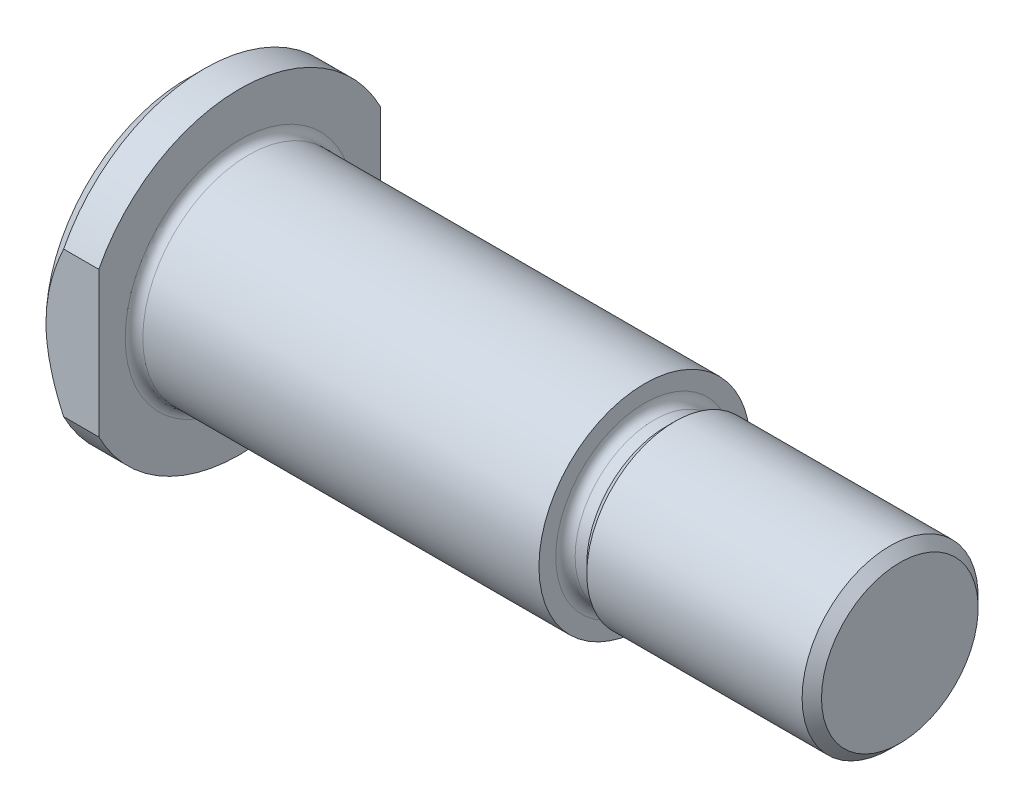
ISO-10303-21;
HEADER;
FILE_DESCRIPTION(('STEP AP214'),'2;1');
FILE_NAME('part.step','',(''),(''),'','','');
FILE_SCHEMA(('AUTOMOTIVE_DESIGN { 1 0 10303 214 1 1 1 1 }'));
ENDSEC;
DATA;
#1=APPLICATION_CONTEXT('core data for automotive mechanical design processes');
#2=APPLICATION_PROTOCOL_DEFINITION('international standard','automotive_design',2000,#1);
#3=PRODUCT_CONTEXT('',#1,'mechanical');
#4=PRODUCT('Part','Part','',(#3));
#5=PRODUCT_RELATED_PRODUCT_CATEGORY('part','',(#4));
#6=PRODUCT_DEFINITION_FORMATION('','',#4);
#7=PRODUCT_DEFINITION_CONTEXT('part definition',#1,'design');
#8=PRODUCT_DEFINITION('design','',#6,#7);
#9=PRODUCT_DEFINITION_SHAPE('','',#8);
#10=(LENGTH_UNIT() NAMED_UNIT(*) SI_UNIT(.MILLI.,.METRE.));
#11=(NAMED_UNIT(*) PLANE_ANGLE_UNIT() SI_UNIT($,.RADIAN.));
#12=(NAMED_UNIT(*) SI_UNIT($,.STERADIAN.) SOLID_ANGLE_UNIT());
#13=UNCERTAINTY_MEASURE_WITH_UNIT(LENGTH_MEASURE(1.E-05),#10,'distance_accuracy_value','');
#14=(GEOMETRIC_REPRESENTATION_CONTEXT(3) GLOBAL_UNCERTAINTY_ASSIGNED_CONTEXT((#13)) GLOBAL_UNIT_ASSIGNED_CONTEXT((#10,
#11,#12)) REPRESENTATION_CONTEXT('',''));
#15=CARTESIAN_POINT('',(0.,0.,0.));
#16=DIRECTION('',(0.,0.,1.));
#17=DIRECTION('',(1.,0.,0.));
#18=AXIS2_PLACEMENT_3D('',#15,#16,#17);
#19=CARTESIAN_POINT('',(-6.34999999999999,0.,0.));
#20=DIRECTION('',(-1.,0.,0.));
#21=DIRECTION('',(0.,0.,1.));
#22=AXIS2_PLACEMENT_3D('',#19,#20,#21);
#23=CYLINDRICAL_SURFACE('',#22,18.);
#24=DIRECTION('',(-1.,0.,0.));
#25=VECTOR('',#24,1.);
#26=CARTESIAN_POINT('',(-6.34999999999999,8.24621125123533,16.));
#27=LINE('',#26,#25);
#28=CARTESIAN_POINT('',(6.,8.24621125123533,16.));
#29=VERTEX_POINT('',#28);
#30=CARTESIAN_POINT('',(2.,8.24621125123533,16.));
#31=VERTEX_POINT('',#30);
#32=EDGE_CURVE('E84',#29,#31,#27,.T.);
#33=ORIENTED_EDGE('',*,*,#32,.F.);
#34=CARTESIAN_POINT('',(6.,0.,0.));
#35=DIRECTION('',(-1.,0.,0.));
#36=DIRECTION('',(0.,0.,1.));
#37=AXIS2_PLACEMENT_3D('',#34,#35,#36);
#38=CIRCLE('',#37,18.);
#39=CARTESIAN_POINT('',(6.,8.24621125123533,-16.));
#40=VERTEX_POINT('',#39);
#41=EDGE_CURVE('E96',#29,#40,#38,.T.);
#42=ORIENTED_EDGE('',*,*,#41,.T.);
#43=DIRECTION('',(-1.,0.,0.));
#44=VECTOR('',#43,1.);
#45=CARTESIAN_POINT('',(-6.34999999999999,8.24621125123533,-16.));
#46=LINE('',#45,#44);
#47=CARTESIAN_POINT('',(2.,8.24621125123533,-16.));
#48=VERTEX_POINT('',#47);
#49=EDGE_CURVE('E176',#48,#40,#46,.F.);
#50=ORIENTED_EDGE('',*,*,#49,.F.);
#51=CARTESIAN_POINT('',(2.,0.,0.));
#52=DIRECTION('',(-1.,0.,0.));
#53=DIRECTION('',(0.,0.,1.));
#54=AXIS2_PLACEMENT_3D('',#51,#52,#53);
#55=CIRCLE('',#54,18.);
#56=EDGE_CURVE('E98',#31,#48,#55,.T.);
#57=ORIENTED_EDGE('',*,*,#56,.F.);
#58=EDGE_LOOP('',(#33,#42,#50,#57));
#59=FACE_BOUND('',#58,.T.);
#60=ADVANCED_FACE('F35',(#59),#23,.T.);
#61=CARTESIAN_POINT('',(0.,0.,0.));
#62=DIRECTION('',(1.,0.,0.));
#63=DIRECTION('',(0.,0.,-1.));
#64=AXIS2_PLACEMENT_3D('',#61,#62,#63);
#65=CONICAL_SURFACE('',#64,16.,0.785398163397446);
#66=CARTESIAN_POINT('',(4.23631170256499,-12.3898471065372,16.));
#67=CARTESIAN_POINT('',(4.05147895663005,-12.087915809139,16.));
#68=CARTESIAN_POINT('',(3.86966755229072,-11.7841061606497,16.));
#69=CARTESIAN_POINT('',(3.51303537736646,-11.172315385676,16.));
#70=CARTESIAN_POINT('',(3.33821634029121,-10.8643332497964,16.));
#71=CARTESIAN_POINT('',(2.99588293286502,-10.2426127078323,16.));
#72=CARTESIAN_POINT('',(2.82840276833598,-9.92885539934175,16.));
#73=CARTESIAN_POINT('',(2.50276930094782,-9.29655507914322,16.));
#74=CARTESIAN_POINT('',(2.34461538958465,-8.97801238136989,16.));
#75=CARTESIAN_POINT('',(2.03589919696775,-8.32926566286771,16.));
#76=CARTESIAN_POINT('',(1.88555682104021,-7.99895624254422,16.));
#77=CARTESIAN_POINT('',(1.59771441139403,-7.33279308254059,16.));
#78=CARTESIAN_POINT('',(1.46021552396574,-6.99693885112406,16.));
#79=CARTESIAN_POINT('',(1.07025580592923,-5.98189570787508,16.));
#80=CARTESIAN_POINT('',(0.839686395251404,-5.29390269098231,16.));
#81=CARTESIAN_POINT('',(0.536854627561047,-4.19695393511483,16.));
#82=CARTESIAN_POINT('',(0.439117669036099,-3.79494869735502,16.));
#83=CARTESIAN_POINT('',(0.271263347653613,-2.98509748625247,16.));
#84=CARTESIAN_POINT('',(0.201147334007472,-2.5772512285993,16.));
#85=CARTESIAN_POINT('',(0.0916160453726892,-1.76124873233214,16.));
#86=CARTESIAN_POINT('',(0.0519236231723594,-1.35313003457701,16.));
#87=CARTESIAN_POINT('',(0.00373371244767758,-0.535035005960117,16.));
#88=CARTESIAN_POINT('',(-0.004763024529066,-0.125058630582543,16.));
#89=CARTESIAN_POINT('',(0.0110887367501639,0.765238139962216,16.));
#90=CARTESIAN_POINT('',(0.0413716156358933,1.24546215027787,16.));
#91=CARTESIAN_POINT('',(0.143735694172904,2.20143974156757,16.));
#92=CARTESIAN_POINT('',(0.215825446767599,2.67719238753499,16.));
#93=CARTESIAN_POINT('',(0.399314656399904,3.62736179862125,16.));
#94=CARTESIAN_POINT('',(0.51121168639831,4.10168125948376,16.));
#95=CARTESIAN_POINT('',(0.7691655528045,5.04072046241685,16.));
#96=CARTESIAN_POINT('',(0.915216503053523,5.50544184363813,16.));
#97=CARTESIAN_POINT('',(1.26343533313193,6.50228790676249,16.));
#98=CARTESIAN_POINT('',(1.47091462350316,7.03254392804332,16.));
#99=CARTESIAN_POINT('',(1.91796697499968,8.07946920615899,16.));
#100=CARTESIAN_POINT('',(2.15755521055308,8.59613189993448,16.));
#101=CARTESIAN_POINT('',(2.66319768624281,9.61836359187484,16.));
#102=CARTESIAN_POINT('',(2.92933668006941,10.1238903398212,16.));
#103=CARTESIAN_POINT('',(3.48220267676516,11.1233766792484,16.));
#104=CARTESIAN_POINT('',(3.76892640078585,11.6173380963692,16.));
#105=CARTESIAN_POINT('',(4.34625875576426,12.5741556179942,16.));
#106=CARTESIAN_POINT('',(4.63616885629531,13.0374353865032,16.));
#107=CARTESIAN_POINT('',(5.22843648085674,13.955993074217,16.));
#108=CARTESIAN_POINT('',(5.53079499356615,14.4112703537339,16.));
#109=CARTESIAN_POINT('',(6.14324612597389,15.3111433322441,16.));
#110=CARTESIAN_POINT('',(6.45325536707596,15.7557959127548,16.));
#111=CARTESIAN_POINT('',(6.92452438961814,16.4182167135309,16.));
#112=CARTESIAN_POINT('',(7.08263534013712,16.6382352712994,16.));
#113=CARTESIAN_POINT('',(7.40078352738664,17.0768686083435,16.));
#114=CARTESIAN_POINT('',(7.56082072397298,17.2954834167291,16.));
#115=CARTESIAN_POINT('',(7.72173860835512,17.5134486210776,16.));
#116=B_SPLINE_CURVE_WITH_KNOTS('',3,(#66,#67,#68,#69,#70,#71,#72,#73,#74,#75,#76,#77,#78,#79,
#80,#81,#82,#83,#84,#85,#86,#87,#88,#89,#90,#91,#92,#93,#94,#95,#96,#97,#98,#99,#100,#101,#102,
#103,#104,#105,#106,#107,#108,#109,#110,#111,#112,#113,#114,#115),.UNSPECIFIED.,.F.,.F.,(4,2,2,
2,2,2,2,2,2,2,2,2,2,2,2,2,2,2,2,2,2,2,2,2,4),(0.,1.06205923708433,2.12438016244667,
3.19121635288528,4.25798285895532,5.34645202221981,6.43501823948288,8.60774448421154,
9.84810200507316,11.0885201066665,12.3174995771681,13.5465086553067,14.9880626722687,
16.429911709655,17.8904558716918,19.3507485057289,21.0576172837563,22.7652955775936,
24.4786109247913,26.1916539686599,27.8309565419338,29.470389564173,31.0964272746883,
31.9092319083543,32.7220196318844),.UNSPECIFIED.);
#117=CARTESIAN_POINT('',(0.,0.,16.));
#118=VERTEX_POINT('',#117);
#119=EDGE_CURVE('E50',#31,#118,#116,.F.);
#120=ORIENTED_EDGE('',*,*,#119,.F.);
#121=ORIENTED_EDGE('',*,*,#56,.T.);
#122=CARTESIAN_POINT('',(4.236311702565,-12.3898471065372,-16.));
#123=CARTESIAN_POINT('',(4.05147895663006,-12.087915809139,-16.));
#124=CARTESIAN_POINT('',(3.86966755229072,-11.7841061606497,-16.));
#125=CARTESIAN_POINT('',(3.51303537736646,-11.172315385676,-16.));
#126=CARTESIAN_POINT('',(3.33821634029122,-10.8643332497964,-16.));
#127=CARTESIAN_POINT('',(2.99588293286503,-10.2426127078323,-16.));
#128=CARTESIAN_POINT('',(2.82840276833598,-9.92885539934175,-16.));
#129=CARTESIAN_POINT('',(2.50276930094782,-9.29655507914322,-16.));
#130=CARTESIAN_POINT('',(2.34461538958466,-8.97801238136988,-16.));
#131=CARTESIAN_POINT('',(2.03589919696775,-8.32926566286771,-16.));
#132=CARTESIAN_POINT('',(1.88555682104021,-7.99895624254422,-16.));
#133=CARTESIAN_POINT('',(1.59771441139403,-7.33279308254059,-16.));
#134=CARTESIAN_POINT('',(1.46021552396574,-6.99693885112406,-16.));
#135=CARTESIAN_POINT('',(1.07025580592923,-5.98189570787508,-16.));
#136=CARTESIAN_POINT('',(0.839686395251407,-5.29390269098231,-16.));
#137=CARTESIAN_POINT('',(0.53685462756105,-4.19695393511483,-16.));
#138=CARTESIAN_POINT('',(0.439117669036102,-3.79494869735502,-16.));
#139=CARTESIAN_POINT('',(0.271263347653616,-2.98509748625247,-16.));
#140=CARTESIAN_POINT('',(0.201147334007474,-2.5772512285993,-16.));
#141=CARTESIAN_POINT('',(0.0916160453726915,-1.76124873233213,-16.));
#142=CARTESIAN_POINT('',(0.0519236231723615,-1.353130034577,-16.));
#143=CARTESIAN_POINT('',(0.00373371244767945,-0.535035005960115,-16.));
#144=CARTESIAN_POINT('',(-0.00476302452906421,-0.125058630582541,-16.));
#145=CARTESIAN_POINT('',(0.0110887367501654,0.765238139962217,-16.));
#146=CARTESIAN_POINT('',(0.0413716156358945,1.24546215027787,-16.));
#147=CARTESIAN_POINT('',(0.143735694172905,2.20143974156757,-16.));
#148=CARTESIAN_POINT('',(0.2158254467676,2.67719238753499,-16.));
#149=CARTESIAN_POINT('',(0.399314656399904,3.62736179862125,-16.));
#150=CARTESIAN_POINT('',(0.511211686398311,4.10168125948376,-16.));
#151=CARTESIAN_POINT('',(0.7691655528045,5.04072046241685,-16.));
#152=CARTESIAN_POINT('',(0.915216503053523,5.50544184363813,-16.));
#153=CARTESIAN_POINT('',(1.26343533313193,6.50228790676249,-16.));
#154=CARTESIAN_POINT('',(1.47091462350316,7.03254392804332,-16.));
#155=CARTESIAN_POINT('',(1.91796697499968,8.07946920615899,-16.));
#156=CARTESIAN_POINT('',(2.15755521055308,8.59613189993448,-16.));
#157=CARTESIAN_POINT('',(2.6631976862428,9.61836359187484,-16.));
#158=CARTESIAN_POINT('',(2.9293366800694,10.1238903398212,-16.));
#159=CARTESIAN_POINT('',(3.48220267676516,11.1233766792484,-16.));
#160=CARTESIAN_POINT('',(3.76892640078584,11.6173380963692,-16.));
#161=CARTESIAN_POINT('',(4.34625875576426,12.5741556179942,-16.));
#162=CARTESIAN_POINT('',(4.63616885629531,13.0374353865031,-16.));
#163=CARTESIAN_POINT('',(5.22843648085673,13.955993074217,-16.));
#164=CARTESIAN_POINT('',(5.53079499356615,14.4112703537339,-16.));
#165=CARTESIAN_POINT('',(6.14324612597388,15.3111433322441,-16.));
#166=CARTESIAN_POINT('',(6.45325536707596,15.7557959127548,-16.));
#167=CARTESIAN_POINT('',(6.92452438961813,16.4182167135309,-16.));
#168=CARTESIAN_POINT('',(7.08263534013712,16.6382352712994,-16.));
#169=CARTESIAN_POINT('',(7.40078352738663,17.0768686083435,-16.));
#170=CARTESIAN_POINT('',(7.56082072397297,17.2954834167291,-16.));
#171=CARTESIAN_POINT('',(7.72173860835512,17.5134486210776,-16.));
#172=B_SPLINE_CURVE_WITH_KNOTS('',3,(#122,#123,#124,#125,#126,#127,#128,#129,#130,#131,#132,
#133,#134,#135,#136,#137,#138,#139,#140,#141,#142,#143,#144,#145,#146,#147,#148,#149,#150,#151,
#152,#153,#154,#155,#156,#157,#158,#159,#160,#161,#162,#163,#164,#165,#166,#167,#168,#169,#170,
#171),.UNSPECIFIED.,.F.,.F.,(4,2,2,2,2,2,2,2,2,2,2,2,2,2,2,2,2,2,2,2,2,2,2,2,4),(0.,
1.06205923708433,2.12438016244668,3.19121635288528,4.25798285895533,5.34645202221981,
6.43501823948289,8.60774448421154,9.84810200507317,11.0885201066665,12.3174995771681,
13.5465086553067,14.9880626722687,16.429911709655,17.8904558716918,19.3507485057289,
21.0576172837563,22.7652955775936,24.4786109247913,26.1916539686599,27.8309565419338,
29.470389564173,31.0964272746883,31.9092319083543,32.7220196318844),.UNSPECIFIED.);
#173=CARTESIAN_POINT('',(0.,0.,-16.));
#174=VERTEX_POINT('',#173);
#175=EDGE_CURVE('E174',#174,#48,#172,.T.);
#176=ORIENTED_EDGE('',*,*,#175,.F.);
#177=CARTESIAN_POINT('',(0.,0.,0.));
#178=DIRECTION('',(-1.,0.,0.));
#179=DIRECTION('',(0.,0.,1.));
#180=AXIS2_PLACEMENT_3D('',#177,#178,#179);
#181=CIRCLE('',#180,16.);
#182=EDGE_CURVE('E57',#118,#174,#181,.T.);
#183=ORIENTED_EDGE('',*,*,#182,.F.);
#184=EDGE_LOOP('',(#120,#121,#176,#183));
#185=FACE_BOUND('',#184,.T.);
#186=ADVANCED_FACE('F143',(#185),#65,.T.);
#187=CARTESIAN_POINT('',(81.,8.89850000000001,0.));
#188=DIRECTION('',(1.,0.,0.));
#189=DIRECTION('',(0.,0.,-1.));
#190=AXIS2_PLACEMENT_3D('',#187,#188,#189);
#191=PLANE('',#190);
#192=CARTESIAN_POINT('',(81.,0.,0.));
#193=DIRECTION('',(-1.,0.,0.));
#194=DIRECTION('',(0.,0.,1.));
#195=AXIS2_PLACEMENT_3D('',#192,#193,#194);
#196=CIRCLE('',#195,8.89850000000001);
#197=CARTESIAN_POINT('',(81.,0.,8.89850000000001));
#198=VERTEX_POINT('',#197);
#199=EDGE_CURVE('E128',#198,#198,#196,.T.);
#200=ORIENTED_EDGE('',*,*,#199,.F.);
#201=EDGE_LOOP('',(#200));
#202=FACE_BOUND('',#201,.T.);
#203=ADVANCED_FACE('F149',(#202),#191,.T.);
#204=CARTESIAN_POINT('',(79.8985,0.,0.));
#205=DIRECTION('',(-1.,0.,0.));
#206=DIRECTION('',(0.,0.,1.));
#207=AXIS2_PLACEMENT_3D('',#204,#205,#206);
#208=CONICAL_SURFACE('',#207,10.,0.785398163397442);
#209=ORIENTED_EDGE('',*,*,#199,.T.);
#210=EDGE_LOOP('',(#209));
#211=FACE_BOUND('',#210,.T.);
#212=CARTESIAN_POINT('',(79.8985,0.,0.));
#213=DIRECTION('',(-1.,0.,0.));
#214=DIRECTION('',(0.,0.,1.));
#215=AXIS2_PLACEMENT_3D('',#212,#213,#214);
#216=CIRCLE('',#215,10.);
#217=CARTESIAN_POINT('',(79.8985,0.,10.));
#218=VERTEX_POINT('',#217);
#219=EDGE_CURVE('E125',#218,#218,#216,.T.);
#220=ORIENTED_EDGE('',*,*,#219,.F.);
#221=EDGE_LOOP('',(#220));
#222=FACE_BOUND('',#221,.T.);
#223=ADVANCED_FACE('F299',(#211,#222),#208,.T.);
#224=CARTESIAN_POINT('',(-6.34999999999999,0.,0.));
#225=DIRECTION('',(-1.,0.,0.));
#226=DIRECTION('',(0.,0.,1.));
#227=AXIS2_PLACEMENT_3D('',#224,#225,#226);
#228=CYLINDRICAL_SURFACE('',#227,10.);
#229=ORIENTED_EDGE('',*,*,#219,.T.);
#230=EDGE_LOOP('',(#229));
#231=FACE_BOUND('',#230,.T.);
#232=CARTESIAN_POINT('',(55.435815,0.,0.));
#233=DIRECTION('',(-1.,0.,0.));
#234=DIRECTION('',(0.,0.,1.));
#235=AXIS2_PLACEMENT_3D('',#232,#233,#234);
#236=CIRCLE('',#235,10.);
#237=CARTESIAN_POINT('',(55.435815,0.,10.));
#238=VERTEX_POINT('',#237);
#239=EDGE_CURVE('E122',#238,#238,#236,.T.);
#240=ORIENTED_EDGE('',*,*,#239,.F.);
#241=EDGE_LOOP('',(#240));
#242=FACE_BOUND('',#241,.T.);
#243=ADVANCED_FACE('F288',(#231,#242),#228,.T.);
#244=CARTESIAN_POINT('',(54.4233,0.,0.));
#245=DIRECTION('',(1.,0.,0.));
#246=DIRECTION('',(0.,0.,-1.));
#247=AXIS2_PLACEMENT_3D('',#244,#245,#246);
#248=CONICAL_SURFACE('',#247,8.987485,0.785398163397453);
#249=ORIENTED_EDGE('',*,*,#239,.T.);
#250=EDGE_LOOP('',(#249));
#251=FACE_BOUND('',#250,.T.);
#252=CARTESIAN_POINT('',(54.4233,0.,0.));
#253=DIRECTION('',(-1.,0.,0.));
#254=DIRECTION('',(0.,0.,1.));
#255=AXIS2_PLACEMENT_3D('',#252,#253,#254);
#256=CIRCLE('',#255,8.987485);
#257=CARTESIAN_POINT('',(54.4233,0.,8.987485));
#258=VERTEX_POINT('',#257);
#259=EDGE_CURVE('E119',#258,#258,#256,.T.);
#260=ORIENTED_EDGE('',*,*,#259,.F.);
#261=EDGE_LOOP('',(#260));
#262=FACE_BOUND('',#261,.T.);
#263=ADVANCED_FACE('F278',(#251,#262),#248,.T.);
#264=CARTESIAN_POINT('',(-6.34999999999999,0.,0.));
#265=DIRECTION('',(-1.,0.,0.));
#266=DIRECTION('',(0.,0.,1.));
#267=AXIS2_PLACEMENT_3D('',#264,#265,#266);
#268=CYLINDRICAL_SURFACE('',#267,8.987485);
#269=ORIENTED_EDGE('',*,*,#259,.T.);
#270=EDGE_LOOP('',(#269));
#271=FACE_BOUND('',#270,.T.);
#272=CARTESIAN_POINT('',(53.1015,0.,0.));
#273=DIRECTION('',(-1.,0.,0.));
#274=DIRECTION('',(0.,0.,1.));
#275=AXIS2_PLACEMENT_3D('',#272,#273,#274);
#276=CIRCLE('',#275,8.987485);
#277=CARTESIAN_POINT('',(53.1015,0.,8.987485));
#278=VERTEX_POINT('',#277);
#279=EDGE_CURVE('E116',#278,#278,#276,.T.);
#280=ORIENTED_EDGE('',*,*,#279,.F.);
#281=EDGE_LOOP('',(#280));
#282=FACE_BOUND('',#281,.T.);
#283=ADVANCED_FACE('F268',(#271,#282),#268,.T.);
#284=CARTESIAN_POINT('',(53.1015,0.,0.));
#285=DIRECTION('',(-1.,0.,0.));
#286=DIRECTION('',(0.,0.,1.));
#287=AXIS2_PLACEMENT_3D('',#284,#285,#286);
#288=TOROIDAL_SURFACE('',#287,10.088985,1.1015);
#289=ORIENTED_EDGE('',*,*,#279,.T.);
#290=EDGE_LOOP('',(#289));
#291=FACE_BOUND('',#290,.T.);
#292=CARTESIAN_POINT('',(52.,0.,0.));
#293=DIRECTION('',(-1.,0.,0.));
#294=DIRECTION('',(0.,0.,1.));
#295=AXIS2_PLACEMENT_3D('',#292,#293,#294);
#296=CIRCLE('',#295,10.088985);
#297=CARTESIAN_POINT('',(52.,0.,10.088985));
#298=VERTEX_POINT('',#297);
#299=EDGE_CURVE('E113',#298,#298,#296,.T.);
#300=ORIENTED_EDGE('',*,*,#299,.F.);
#301=EDGE_LOOP('',(#300));
#302=FACE_BOUND('',#301,.T.);
#303=ADVANCED_FACE('F258',(#291,#302),#288,.F.);
#304=CARTESIAN_POINT('',(52.,12.,0.));
#305=DIRECTION('',(1.,0.,0.));
#306=DIRECTION('',(0.,0.,-1.));
#307=AXIS2_PLACEMENT_3D('',#304,#305,#306);
#308=PLANE('',#307);
#309=ORIENTED_EDGE('',*,*,#299,.T.);
#310=EDGE_LOOP('',(#309));
#311=FACE_BOUND('',#310,.T.);
#312=CARTESIAN_POINT('',(52.,0.,0.));
#313=DIRECTION('',(-1.,0.,0.));
#314=DIRECTION('',(0.,0.,1.));
#315=AXIS2_PLACEMENT_3D('',#312,#313,#314);
#316=CIRCLE('',#315,12.);
#317=CARTESIAN_POINT('',(52.,0.,12.));
#318=VERTEX_POINT('',#317);
#319=EDGE_CURVE('E106',#318,#318,#316,.T.);
#320=ORIENTED_EDGE('',*,*,#319,.F.);
#321=EDGE_LOOP('',(#320));
#322=FACE_BOUND('',#321,.T.);
#323=ADVANCED_FACE('F218',(#311,#322),#308,.T.);
#324=CARTESIAN_POINT('',(-6.34999999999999,0.,0.));
#325=DIRECTION('',(-1.,0.,0.));
#326=DIRECTION('',(0.,0.,1.));
#327=AXIS2_PLACEMENT_3D('',#324,#325,#326);
#328=CYLINDRICAL_SURFACE('',#327,12.);
#329=CARTESIAN_POINT('',(7.,0.,0.));
#330=DIRECTION('',(1.,0.,0.));
#331=DIRECTION('',(0.,0.,-1.));
#332=AXIS2_PLACEMENT_3D('',#329,#330,#331);
#333=CIRCLE('',#332,12.);
#334=CARTESIAN_POINT('',(7.,0.,-12.));
#335=VERTEX_POINT('',#334);
#336=EDGE_CURVE('E11',#335,#335,#333,.T.);
#337=ORIENTED_EDGE('',*,*,#336,.T.);
#338=EDGE_LOOP('',(#337));
#339=FACE_BOUND('',#338,.T.);
#340=ORIENTED_EDGE('',*,*,#319,.T.);
#341=EDGE_LOOP('',(#340));
#342=FACE_BOUND('',#341,.T.);
#343=ADVANCED_FACE('F162',(#339,#342),#328,.T.);
#344=CARTESIAN_POINT('',(6.,18.,0.));
#345=DIRECTION('',(1.,0.,0.));
#346=DIRECTION('',(0.,0.,-1.));
#347=AXIS2_PLACEMENT_3D('',#344,#345,#346);
#348=PLANE('',#347);
#349=CARTESIAN_POINT('',(6.,0.,0.));
#350=DIRECTION('',(1.,0.,0.));
#351=DIRECTION('',(0.,0.,-1.));
#352=AXIS2_PLACEMENT_3D('',#349,#350,#351);
#353=CIRCLE('',#352,13.);
#354=CARTESIAN_POINT('',(6.,0.,-13.));
#355=VERTEX_POINT('',#354);
#356=EDGE_CURVE('E43',#355,#355,#353,.F.);
#357=ORIENTED_EDGE('',*,*,#356,.T.);
#358=EDGE_LOOP('',(#357));
#359=FACE_BOUND('',#358,.T.);
#360=DIRECTION('',(0.,-1.,0.));
#361=VECTOR('',#360,1.);
#362=CARTESIAN_POINT('',(6.,-18.,16.));
#363=LINE('',#362,#361);
#364=CARTESIAN_POINT('',(6.,-8.24621125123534,16.));
#365=VERTEX_POINT('',#364);
#366=EDGE_CURVE('E81',#29,#365,#363,.T.);
#367=ORIENTED_EDGE('',*,*,#366,.T.);
#368=CARTESIAN_POINT('',(6.,-8.24621125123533,-16.));
#369=VERTEX_POINT('',#368);
#370=EDGE_CURVE('E103',#369,#365,#38,.T.);
#371=ORIENTED_EDGE('',*,*,#370,.F.);
#372=DIRECTION('',(0.,1.,0.));
#373=VECTOR('',#372,1.);
#374=CARTESIAN_POINT('',(6.,-18.,-16.));
#375=LINE('',#374,#373);
#376=EDGE_CURVE('E102',#369,#40,#375,.T.);
#377=ORIENTED_EDGE('',*,*,#376,.T.);
#378=ORIENTED_EDGE('',*,*,#41,.F.);
#379=EDGE_LOOP('',(#367,#371,#377,#378));
#380=FACE_BOUND('',#379,.T.);
#381=ADVANCED_FACE('F101',(#359,#380),#348,.T.);
#382=DIRECTION('',(-1.,0.,0.));
#383=VECTOR('',#382,1.);
#384=CARTESIAN_POINT('',(-6.34999999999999,-8.24621125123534,16.));
#385=LINE('',#384,#383);
#386=CARTESIAN_POINT('',(2.,-8.24621125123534,16.));
#387=VERTEX_POINT('',#386);
#388=EDGE_CURVE('E86',#387,#365,#385,.F.);
#389=ORIENTED_EDGE('',*,*,#388,.F.);
#390=CARTESIAN_POINT('',(2.,-8.24621125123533,-16.));
#391=VERTEX_POINT('',#390);
#392=EDGE_CURVE('E104',#391,#387,#55,.T.);
#393=ORIENTED_EDGE('',*,*,#392,.F.);
#394=DIRECTION('',(-1.,0.,0.));
#395=VECTOR('',#394,1.);
#396=CARTESIAN_POINT('',(-6.34999999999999,-8.24621125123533,-16.));
#397=LINE('',#396,#395);
#398=EDGE_CURVE('E173',#369,#391,#397,.T.);
#399=ORIENTED_EDGE('',*,*,#398,.F.);
#400=ORIENTED_EDGE('',*,*,#370,.T.);
#401=EDGE_LOOP('',(#389,#393,#399,#400));
#402=FACE_BOUND('',#401,.T.);
#403=ADVANCED_FACE('F145',(#402),#23,.T.);
#404=EDGE_CURVE('E91',#118,#387,#116,.F.);
#405=ORIENTED_EDGE('',*,*,#404,.F.);
#406=EDGE_CURVE('E169',#174,#118,#181,.T.);
#407=ORIENTED_EDGE('',*,*,#406,.F.);
#408=EDGE_CURVE('E168',#391,#174,#172,.T.);
#409=ORIENTED_EDGE('',*,*,#408,.F.);
#410=ORIENTED_EDGE('',*,*,#392,.T.);
#411=EDGE_LOOP('',(#405,#407,#409,#410));
#412=FACE_BOUND('',#411,.T.);
#413=ADVANCED_FACE('F152',(#412),#65,.T.);
#414=CARTESIAN_POINT('',(0.,0.,0.));
#415=DIRECTION('',(-1.,0.,0.));
#416=DIRECTION('',(0.,0.,1.));
#417=AXIS2_PLACEMENT_3D('',#414,#415,#416);
#418=PLANE('',#417);
#419=ORIENTED_EDGE('',*,*,#406,.T.);
#420=ORIENTED_EDGE('',*,*,#182,.T.);
#421=EDGE_LOOP('',(#419,#420));
#422=FACE_BOUND('',#421,.T.);
#423=ADVANCED_FACE('F160',(#422),#418,.T.);
#424=CARTESIAN_POINT('',(42.0555127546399,-18.,-16.));
#425=DIRECTION('',(0.,0.,1.));
#426=DIRECTION('',(0.,-1.,0.));
#427=AXIS2_PLACEMENT_3D('',#424,#425,#426);
#428=PLANE('',#427);
#429=ORIENTED_EDGE('',*,*,#49,.T.);
#430=ORIENTED_EDGE('',*,*,#376,.F.);
#431=ORIENTED_EDGE('',*,*,#398,.T.);
#432=ORIENTED_EDGE('',*,*,#408,.T.);
#433=ORIENTED_EDGE('',*,*,#175,.T.);
#434=EDGE_LOOP('',(#429,#430,#431,#432,#433));
#435=FACE_BOUND('',#434,.T.);
#436=ADVANCED_FACE('F139',(#435),#428,.F.);
#437=CARTESIAN_POINT('',(42.0555127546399,-18.,16.));
#438=DIRECTION('',(0.,0.,-1.));
#439=DIRECTION('',(0.,1.,0.));
#440=AXIS2_PLACEMENT_3D('',#437,#438,#439);
#441=PLANE('',#440);
#442=ORIENTED_EDGE('',*,*,#388,.T.);
#443=ORIENTED_EDGE('',*,*,#366,.F.);
#444=ORIENTED_EDGE('',*,*,#32,.T.);
#445=ORIENTED_EDGE('',*,*,#119,.T.);
#446=ORIENTED_EDGE('',*,*,#404,.T.);
#447=EDGE_LOOP('',(#442,#443,#444,#445,#446));
#448=FACE_BOUND('',#447,.T.);
#449=ADVANCED_FACE('F83',(#448),#441,.F.);
#450=CARTESIAN_POINT('',(7.,0.,0.));
#451=DIRECTION('',(1.,0.,0.));
#452=DIRECTION('',(0.,0.,-1.));
#453=AXIS2_PLACEMENT_3D('',#450,#451,#452);
#454=TOROIDAL_SURFACE('',#453,13.,1.);
#455=ORIENTED_EDGE('',*,*,#336,.F.);
#456=EDGE_LOOP('',(#455));
#457=FACE_BOUND('',#456,.T.);
#458=ORIENTED_EDGE('',*,*,#356,.F.);
#459=EDGE_LOOP('',(#458));
#460=FACE_BOUND('',#459,.T.);
#461=ADVANCED_FACE('F37',(#457,#460),#454,.F.);
#462=CLOSED_SHELL('',(#60,#186,#203,#223,#243,#263,#283,#303,#323,#343,#381,#403,#413,#423,#436,
#449,#461));
#463=MANIFOLD_SOLID_BREP('B2',#462);
#464=ADVANCED_BREP_SHAPE_REPRESENTATION('',(#18,#463),#14);
#465=SHAPE_DEFINITION_REPRESENTATION(#9,#464);
ENDSEC;
END-ISO-10303-21;
